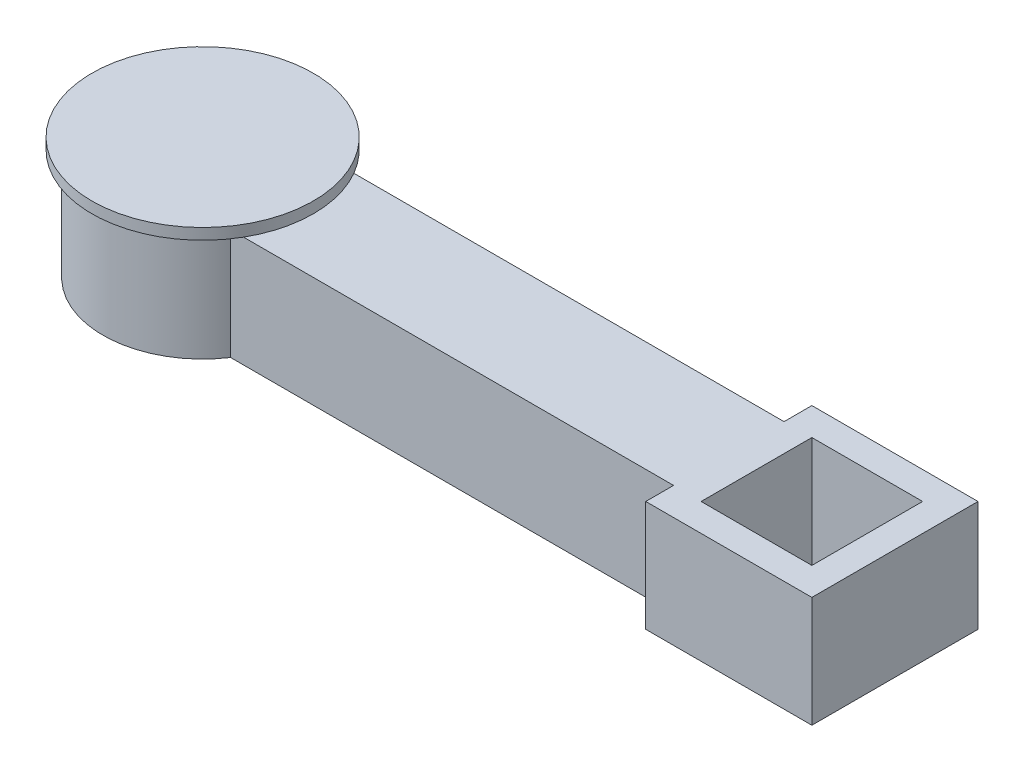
from build123d import *

# Parameters (mm, degrees)
SKETCH1_W           = 150
SKETCH1_H           = 150
BOSS_EXTRUDE1_DEPTH = 100
SKETCH5_R           = 70
CUT_EXTRUDE2_DEPTH  = 100
SKETCH6_R           = 100
BOSS_EXTRUDE4_DEPTH = 10
SKETCH7_W           = 100
SKETCH7_H           = 100
CUT_EXTRUDE3_DEPTH  = 100


with BuildPart() as part:
    # Sketch1 → Boss-Extrude1 (new body)
    with BuildSketch(Plane(origin=(0, 0, 0), x_dir=(1, 0, 0), z_dir=(0, 1, 0))):
        with BuildLine():
            Line((163.145565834, 275.992438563), (163.145565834, 275.741810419))
            ThreePointArc((163.145565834, 275.741810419), (-1.854434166, 225.992438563), (163.145565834, 176.243066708))
            Line((163.145565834, 176.243066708), (563.145565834, 176.243066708))
            Line((563.145565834, 176.243066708), (563.145565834, 275.741810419))
            Line((563.145565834, 275.741810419), (563.145565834, 275.992438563))
            Line((563.145565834, 275.992438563), (163.145565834, 275.992438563))
        make_face()
        with Locations((638.145565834, 226.117752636)):
            Rectangle(SKETCH1_W, SKETCH1_H)
    extrude(amount=BOSS_EXTRUDE1_DEPTH)

    # Sketch5 → Cut-Extrude2 (cut)
    with BuildSketch(Plane(origin=(0, 100, 0), x_dir=(1, 0, 0), z_dir=(0, 1, 0))):
        with Locations(Location((88.145565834, 225.992438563, 0), (0, 0, 270))):
            Circle(SKETCH5_R)
    extrude(amount=-CUT_EXTRUDE2_DEPTH, mode=Mode.SUBTRACT)

    # Sketch6 → Boss-Extrude4 (add)
    with BuildSketch(Plane(origin=(0, 100, 0), x_dir=(1, 0, 0), z_dir=(0, 1, 0))):
        with Locations(Location((88.145565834, 225.992438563, 0), (0, 0, 30))):
            Circle(SKETCH6_R)
    extrude(amount=BOSS_EXTRUDE4_DEPTH)

    # Sketch7 → Cut-Extrude3 (cut)
    with BuildSketch(Plane(origin=(0, 100, 0), x_dir=(1, 0, 0), z_dir=(0, 1, 0))):
        with Locations((638.145565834, 226.117752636)):
            Rectangle(SKETCH7_W, SKETCH7_H)
    extrude(amount=-CUT_EXTRUDE3_DEPTH, mode=Mode.SUBTRACT)


solid = part.part
